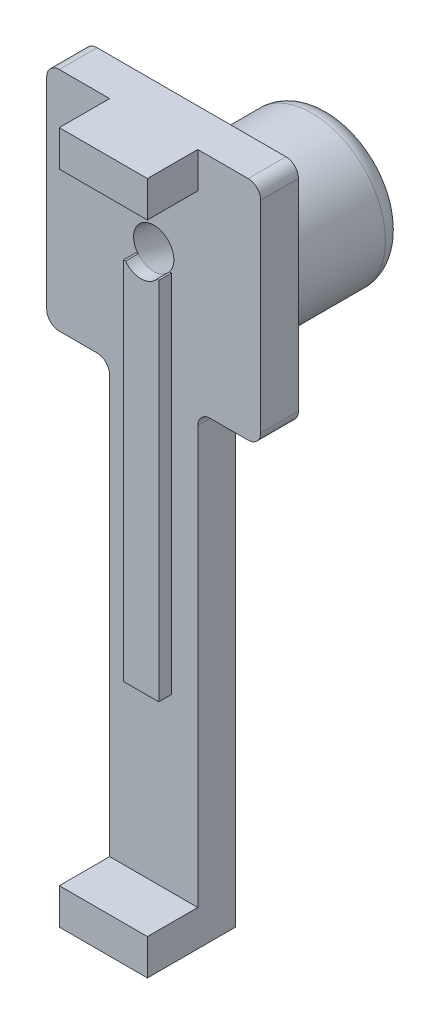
ISO-10303-21;
HEADER;
FILE_DESCRIPTION(('STEP AP214'),'2;1');
FILE_NAME('part.step','',(''),(''),'','','');
FILE_SCHEMA(('AUTOMOTIVE_DESIGN { 1 0 10303 214 1 1 1 1 }'));
ENDSEC;
DATA;
#1=APPLICATION_CONTEXT('core data for automotive mechanical design processes');
#2=APPLICATION_PROTOCOL_DEFINITION('international standard','automotive_design',2000,#1);
#3=PRODUCT_CONTEXT('',#1,'mechanical');
#4=PRODUCT('Part','Part','',(#3));
#5=PRODUCT_RELATED_PRODUCT_CATEGORY('part','',(#4));
#6=PRODUCT_DEFINITION_FORMATION('','',#4);
#7=PRODUCT_DEFINITION_CONTEXT('part definition',#1,'design');
#8=PRODUCT_DEFINITION('design','',#6,#7);
#9=PRODUCT_DEFINITION_SHAPE('','',#8);
#10=(LENGTH_UNIT() NAMED_UNIT(*) SI_UNIT(.MILLI.,.METRE.));
#11=(NAMED_UNIT(*) PLANE_ANGLE_UNIT() SI_UNIT($,.RADIAN.));
#12=(NAMED_UNIT(*) SI_UNIT($,.STERADIAN.) SOLID_ANGLE_UNIT());
#13=UNCERTAINTY_MEASURE_WITH_UNIT(LENGTH_MEASURE(1.E-05),#10,'distance_accuracy_value','');
#14=(GEOMETRIC_REPRESENTATION_CONTEXT(3) GLOBAL_UNCERTAINTY_ASSIGNED_CONTEXT((#13)) GLOBAL_UNIT_ASSIGNED_CONTEXT((#10,
#11,#12)) REPRESENTATION_CONTEXT('',''));
#15=CARTESIAN_POINT('',(0.,0.,0.));
#16=DIRECTION('',(0.,0.,1.));
#17=DIRECTION('',(1.,0.,0.));
#18=AXIS2_PLACEMENT_3D('',#15,#16,#17);
#19=CARTESIAN_POINT('',(1.4,26.9951042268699,4.));
#20=DIRECTION('',(0.,-1.,0.));
#21=DIRECTION('',(0.,0.,-1.));
#22=AXIS2_PLACEMENT_3D('',#19,#20,#21);
#23=PLANE('',#22);
#24=DIRECTION('',(-1.,0.,0.));
#25=VECTOR('',#24,1.);
#26=CARTESIAN_POINT('',(1.4,26.9951042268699,4.));
#27=LINE('',#26,#25);
#28=CARTESIAN_POINT('',(-1.24912299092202,26.9951042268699,4.));
#29=VERTEX_POINT('',#28);
#30=CARTESIAN_POINT('',(-1.4,26.9951042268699,4.));
#31=VERTEX_POINT('',#30);
#32=EDGE_CURVE('E244',#29,#31,#27,.T.);
#33=ORIENTED_EDGE('',*,*,#32,.F.);
#34=DIRECTION('',(0.,0.,-1.));
#35=VECTOR('',#34,1.);
#36=CARTESIAN_POINT('',(-1.24912299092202,26.9951042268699,13.));
#37=LINE('',#36,#35);
#38=CARTESIAN_POINT('',(-1.24912299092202,26.9951042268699,3.));
#39=VERTEX_POINT('',#38);
#40=EDGE_CURVE('E227',#29,#39,#37,.T.);
#41=ORIENTED_EDGE('',*,*,#40,.T.);
#42=DIRECTION('',(-1.,0.,0.));
#43=VECTOR('',#42,1.);
#44=CARTESIAN_POINT('',(1.4,26.9951042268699,3.));
#45=LINE('',#44,#43);
#46=CARTESIAN_POINT('',(-1.4,26.9951042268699,3.));
#47=VERTEX_POINT('',#46);
#48=EDGE_CURVE('E242',#39,#47,#45,.T.);
#49=ORIENTED_EDGE('',*,*,#48,.T.);
#50=DIRECTION('',(0.,0.,-1.));
#51=VECTOR('',#50,1.);
#52=CARTESIAN_POINT('',(-1.4,26.9951042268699,4.));
#53=LINE('',#52,#51);
#54=EDGE_CURVE('E286',#31,#47,#53,.T.);
#55=ORIENTED_EDGE('',*,*,#54,.F.);
#56=EDGE_LOOP('',(#33,#41,#49,#55));
#57=FACE_BOUND('',#56,.T.);
#58=ADVANCED_FACE('F49',(#57),#23,.F.);
#59=CARTESIAN_POINT('',(3.5,0.,3.));
#60=DIRECTION('',(-1.,0.,0.));
#61=DIRECTION('',(0.,0.,1.));
#62=AXIS2_PLACEMENT_3D('',#59,#60,#61);
#63=PLANE('',#62);
#64=DIRECTION('',(0.,1.,0.));
#65=VECTOR('',#64,1.);
#66=CARTESIAN_POINT('',(3.5,0.,0.));
#67=LINE('',#66,#65);
#68=CARTESIAN_POINT('',(3.5,-18.4548957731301,0.));
#69=VERTEX_POINT('',#68);
#70=CARTESIAN_POINT('',(3.5,17.5451042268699,0.));
#71=VERTEX_POINT('',#70);
#72=EDGE_CURVE('E305',#69,#71,#67,.T.);
#73=ORIENTED_EDGE('',*,*,#72,.T.);
#74=DIRECTION('',(0.,0.,-1.));
#75=VECTOR('',#74,1.);
#76=CARTESIAN_POINT('',(3.5,17.5451042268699,3.));
#77=LINE('',#76,#75);
#78=CARTESIAN_POINT('',(3.5,17.5451042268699,3.));
#79=VERTEX_POINT('',#78);
#80=EDGE_CURVE('E371',#71,#79,#77,.F.);
#81=ORIENTED_EDGE('',*,*,#80,.T.);
#82=DIRECTION('',(0.,1.,0.));
#83=VECTOR('',#82,1.);
#84=CARTESIAN_POINT('',(3.5,0.,3.));
#85=LINE('',#84,#83);
#86=CARTESIAN_POINT('',(3.5,-15.6048957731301,3.));
#87=VERTEX_POINT('',#86);
#88=EDGE_CURVE('E295',#87,#79,#85,.T.);
#89=ORIENTED_EDGE('',*,*,#88,.F.);
#90=DIRECTION('',(0.,0.,-1.));
#91=VECTOR('',#90,1.);
#92=CARTESIAN_POINT('',(3.5,-15.6048957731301,7.));
#93=LINE('',#92,#91);
#94=CARTESIAN_POINT('',(3.5,-15.6048957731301,7.));
#95=VERTEX_POINT('',#94);
#96=EDGE_CURVE('E627',#95,#87,#93,.T.);
#97=ORIENTED_EDGE('',*,*,#96,.F.);
#98=DIRECTION('',(0.,1.,0.));
#99=VECTOR('',#98,1.);
#100=CARTESIAN_POINT('',(3.5,-18.4548957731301,7.));
#101=LINE('',#100,#99);
#102=CARTESIAN_POINT('',(3.5,-18.4548957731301,7.));
#103=VERTEX_POINT('',#102);
#104=EDGE_CURVE('E611',#103,#95,#101,.T.);
#105=ORIENTED_EDGE('',*,*,#104,.F.);
#106=DIRECTION('',(0.,0.,-1.));
#107=VECTOR('',#106,1.);
#108=CARTESIAN_POINT('',(3.5,-18.4548957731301,3.));
#109=LINE('',#108,#107);
#110=EDGE_CURVE('E314',#103,#69,#109,.T.);
#111=ORIENTED_EDGE('',*,*,#110,.T.);
#112=EDGE_LOOP('',(#73,#81,#89,#97,#105,#111));
#113=FACE_BOUND('',#112,.T.);
#114=ADVANCED_FACE('F528',(#113),#63,.F.);
#115=DIRECTION('',(0.,-1.,0.));
#116=VECTOR('',#115,1.);
#117=CARTESIAN_POINT('',(3.5,36.5451042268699,3.));
#118=LINE('',#117,#116);
#119=CARTESIAN_POINT('',(3.5,36.5451042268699,3.));
#120=VERTEX_POINT('',#119);
#121=CARTESIAN_POINT('',(3.5,33.6951042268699,3.));
#122=VERTEX_POINT('',#121);
#123=EDGE_CURVE('E235',#120,#122,#118,.T.);
#124=ORIENTED_EDGE('',*,*,#123,.F.);
#125=DIRECTION('',(0.,0.,-1.));
#126=VECTOR('',#125,1.);
#127=CARTESIAN_POINT('',(3.5,36.5451042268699,3.));
#128=LINE('',#127,#126);
#129=CARTESIAN_POINT('',(3.5,36.5451042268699,7.));
#130=VERTEX_POINT('',#129);
#131=EDGE_CURVE('E311',#130,#120,#128,.T.);
#132=ORIENTED_EDGE('',*,*,#131,.F.);
#133=DIRECTION('',(0.,1.,0.));
#134=VECTOR('',#133,1.);
#135=CARTESIAN_POINT('',(3.5,36.5451042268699,7.));
#136=LINE('',#135,#134);
#137=CARTESIAN_POINT('',(3.5,33.6951042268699,7.));
#138=VERTEX_POINT('',#137);
#139=EDGE_CURVE('E636',#138,#130,#136,.T.);
#140=ORIENTED_EDGE('',*,*,#139,.F.);
#141=DIRECTION('',(0.,0.,-1.));
#142=VECTOR('',#141,1.);
#143=CARTESIAN_POINT('',(3.5,33.6951042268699,7.));
#144=LINE('',#143,#142);
#145=EDGE_CURVE('E642',#138,#122,#144,.T.);
#146=ORIENTED_EDGE('',*,*,#145,.T.);
#147=EDGE_LOOP('',(#124,#132,#140,#146));
#148=FACE_BOUND('',#147,.T.);
#149=ADVANCED_FACE('F532',(#148),#63,.F.);
#150=CARTESIAN_POINT('',(-3.5,0.,3.));
#151=DIRECTION('',(-1.,0.,0.));
#152=DIRECTION('',(0.,0.,1.));
#153=AXIS2_PLACEMENT_3D('',#150,#151,#152);
#154=PLANE('',#153);
#155=DIRECTION('',(0.,1.,0.));
#156=VECTOR('',#155,1.);
#157=CARTESIAN_POINT('',(-3.5,36.5451042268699,3.));
#158=LINE('',#157,#156);
#159=CARTESIAN_POINT('',(-3.5,33.6951042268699,3.));
#160=VERTEX_POINT('',#159);
#161=CARTESIAN_POINT('',(-3.5,36.5451042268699,3.));
#162=VERTEX_POINT('',#161);
#163=EDGE_CURVE('E318',#160,#162,#158,.T.);
#164=ORIENTED_EDGE('',*,*,#163,.F.);
#165=DIRECTION('',(0.,0.,-1.));
#166=VECTOR('',#165,1.);
#167=CARTESIAN_POINT('',(-3.5,33.6951042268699,7.));
#168=LINE('',#167,#166);
#169=CARTESIAN_POINT('',(-3.5,33.6951042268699,7.));
#170=VERTEX_POINT('',#169);
#171=EDGE_CURVE('E265',#170,#160,#168,.T.);
#172=ORIENTED_EDGE('',*,*,#171,.F.);
#173=DIRECTION('',(0.,-1.,0.));
#174=VECTOR('',#173,1.);
#175=CARTESIAN_POINT('',(-3.5,36.5451042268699,7.));
#176=LINE('',#175,#174);
#177=CARTESIAN_POINT('',(-3.5,36.5451042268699,7.));
#178=VERTEX_POINT('',#177);
#179=EDGE_CURVE('E631',#178,#170,#176,.T.);
#180=ORIENTED_EDGE('',*,*,#179,.F.);
#181=DIRECTION('',(0.,0.,-1.));
#182=VECTOR('',#181,1.);
#183=CARTESIAN_POINT('',(-3.5,36.5451042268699,3.));
#184=LINE('',#183,#182);
#185=EDGE_CURVE('E299',#178,#162,#184,.T.);
#186=ORIENTED_EDGE('',*,*,#185,.T.);
#187=EDGE_LOOP('',(#164,#172,#180,#186));
#188=FACE_BOUND('',#187,.T.);
#189=ADVANCED_FACE('F460',(#188),#154,.T.);
#190=CARTESIAN_POINT('',(0.,0.,3.));
#191=DIRECTION('',(0.,0.,1.));
#192=DIRECTION('',(1.,0.,0.));
#193=AXIS2_PLACEMENT_3D('',#190,#191,#192);
#194=PLANE('',#193);
#195=CARTESIAN_POINT('',(0.,27.9951042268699,3.));
#196=DIRECTION('',(0.,0.,1.));
#197=DIRECTION('',(1.,0.,0.));
#198=AXIS2_PLACEMENT_3D('',#195,#196,#197);
#199=CIRCLE('',#198,1.6);
#200=CARTESIAN_POINT('',(1.24876445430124,26.995104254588,3.));
#201=VERTEX_POINT('',#200);
#202=EDGE_CURVE('E53',#201,#39,#199,.T.);
#203=ORIENTED_EDGE('',*,*,#202,.F.);
#204=CARTESIAN_POINT('',(1.4,26.9951042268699,3.));
#205=VERTEX_POINT('',#204);
#206=EDGE_CURVE('E260',#205,#201,#45,.T.);
#207=ORIENTED_EDGE('',*,*,#206,.F.);
#208=DIRECTION('',(0.,1.,0.));
#209=VECTOR('',#208,1.);
#210=CARTESIAN_POINT('',(1.4,-2.00489577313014,3.));
#211=LINE('',#210,#209);
#212=CARTESIAN_POINT('',(1.4,-2.00489577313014,3.));
#213=VERTEX_POINT('',#212);
#214=EDGE_CURVE('E261',#213,#205,#211,.T.);
#215=ORIENTED_EDGE('',*,*,#214,.F.);
#216=DIRECTION('',(1.,0.,0.));
#217=VECTOR('',#216,1.);
#218=CARTESIAN_POINT('',(-1.4,-2.00489577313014,3.));
#219=LINE('',#218,#217);
#220=CARTESIAN_POINT('',(-1.4,-2.00489577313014,3.));
#221=VERTEX_POINT('',#220);
#222=EDGE_CURVE('E275',#221,#213,#219,.T.);
#223=ORIENTED_EDGE('',*,*,#222,.F.);
#224=DIRECTION('',(0.,-1.,0.));
#225=VECTOR('',#224,1.);
#226=CARTESIAN_POINT('',(-1.4,26.9951042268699,3.));
#227=LINE('',#226,#225);
#228=EDGE_CURVE('E258',#47,#221,#227,.T.);
#229=ORIENTED_EDGE('',*,*,#228,.F.);
#230=ORIENTED_EDGE('',*,*,#48,.F.);
#231=EDGE_LOOP('',(#203,#207,#215,#223,#229,#230));
#232=FACE_BOUND('',#231,.T.);
#233=DIRECTION('',(0.,1.,0.));
#234=VECTOR('',#233,1.);
#235=CARTESIAN_POINT('',(-8.5,36.5451042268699,3.));
#236=LINE('',#235,#234);
#237=CARTESIAN_POINT('',(-8.5,19.5451042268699,3.));
#238=VERTEX_POINT('',#237);
#239=CARTESIAN_POINT('',(-8.5,35.5451042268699,3.));
#240=VERTEX_POINT('',#239);
#241=EDGE_CURVE('E597',#238,#240,#236,.T.);
#242=ORIENTED_EDGE('',*,*,#241,.F.);
#243=CARTESIAN_POINT('',(-7.5,19.5451042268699,3.));
#244=DIRECTION('',(0.,0.,1.));
#245=DIRECTION('',(1.,0.,0.));
#246=AXIS2_PLACEMENT_3D('',#243,#244,#245);
#247=CIRCLE('',#246,1.);
#248=CARTESIAN_POINT('',(-7.5,18.5451042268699,3.));
#249=VERTEX_POINT('',#248);
#250=EDGE_CURVE('E347',#238,#249,#247,.T.);
#251=ORIENTED_EDGE('',*,*,#250,.T.);
#252=DIRECTION('',(1.,0.,0.));
#253=VECTOR('',#252,1.);
#254=CARTESIAN_POINT('',(-8.5,18.5451042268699,3.));
#255=LINE('',#254,#253);
#256=CARTESIAN_POINT('',(-4.5,18.5451042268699,3.));
#257=VERTEX_POINT('',#256);
#258=EDGE_CURVE('E604',#249,#257,#255,.T.);
#259=ORIENTED_EDGE('',*,*,#258,.T.);
#260=CARTESIAN_POINT('',(-4.5,17.5451042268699,3.));
#261=DIRECTION('',(0.,0.,1.));
#262=DIRECTION('',(1.,0.,0.));
#263=AXIS2_PLACEMENT_3D('',#260,#261,#262);
#264=CIRCLE('',#263,1.);
#265=CARTESIAN_POINT('',(-3.5,17.5451042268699,3.));
#266=VERTEX_POINT('',#265);
#267=EDGE_CURVE('E373',#257,#266,#264,.F.);
#268=ORIENTED_EDGE('',*,*,#267,.T.);
#269=DIRECTION('',(0.,1.,0.));
#270=VECTOR('',#269,1.);
#271=CARTESIAN_POINT('',(-3.5,0.,3.));
#272=LINE('',#271,#270);
#273=CARTESIAN_POINT('',(-3.5,-15.6048957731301,3.));
#274=VERTEX_POINT('',#273);
#275=EDGE_CURVE('E292',#274,#266,#272,.T.);
#276=ORIENTED_EDGE('',*,*,#275,.F.);
#277=DIRECTION('',(-1.,0.,0.));
#278=VECTOR('',#277,1.);
#279=CARTESIAN_POINT('',(3.5,-15.6048957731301,3.));
#280=LINE('',#279,#278);
#281=EDGE_CURVE('E610',#87,#274,#280,.T.);
#282=ORIENTED_EDGE('',*,*,#281,.F.);
#283=ORIENTED_EDGE('',*,*,#88,.T.);
#284=CARTESIAN_POINT('',(4.5,17.5451042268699,3.));
#285=DIRECTION('',(0.,0.,1.));
#286=DIRECTION('',(1.,0.,0.));
#287=AXIS2_PLACEMENT_3D('',#284,#285,#286);
#288=CIRCLE('',#287,1.);
#289=CARTESIAN_POINT('',(4.5,18.5451042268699,3.));
#290=VERTEX_POINT('',#289);
#291=EDGE_CURVE('E12',#79,#290,#288,.F.);
#292=ORIENTED_EDGE('',*,*,#291,.T.);
#293=DIRECTION('',(-1.,0.,0.));
#294=VECTOR('',#293,1.);
#295=CARTESIAN_POINT('',(8.5,18.5451042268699,3.));
#296=LINE('',#295,#294);
#297=CARTESIAN_POINT('',(7.5,18.5451042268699,3.));
#298=VERTEX_POINT('',#297);
#299=EDGE_CURVE('E581',#298,#290,#296,.T.);
#300=ORIENTED_EDGE('',*,*,#299,.F.);
#301=CARTESIAN_POINT('',(7.5,19.5451042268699,3.));
#302=DIRECTION('',(0.,0.,1.));
#303=DIRECTION('',(1.,0.,0.));
#304=AXIS2_PLACEMENT_3D('',#301,#302,#303);
#305=CIRCLE('',#304,1.);
#306=CARTESIAN_POINT('',(8.5,19.5451042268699,3.));
#307=VERTEX_POINT('',#306);
#308=EDGE_CURVE('E341',#298,#307,#305,.T.);
#309=ORIENTED_EDGE('',*,*,#308,.T.);
#310=DIRECTION('',(0.,-1.,0.));
#311=VECTOR('',#310,1.);
#312=CARTESIAN_POINT('',(8.5,36.5451042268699,3.));
#313=LINE('',#312,#311);
#314=CARTESIAN_POINT('',(8.5,35.5451042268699,3.));
#315=VERTEX_POINT('',#314);
#316=EDGE_CURVE('E579',#315,#307,#313,.T.);
#317=ORIENTED_EDGE('',*,*,#316,.F.);
#318=CARTESIAN_POINT('',(7.5,35.5451042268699,3.));
#319=DIRECTION('',(0.,0.,1.));
#320=DIRECTION('',(1.,0.,0.));
#321=AXIS2_PLACEMENT_3D('',#318,#319,#320);
#322=CIRCLE('',#321,1.);
#323=CARTESIAN_POINT('',(7.5,36.5451042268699,3.));
#324=VERTEX_POINT('',#323);
#325=EDGE_CURVE('E343',#315,#324,#322,.T.);
#326=ORIENTED_EDGE('',*,*,#325,.T.);
#327=DIRECTION('',(-1.,0.,0.));
#328=VECTOR('',#327,1.);
#329=CARTESIAN_POINT('',(8.5,36.5451042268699,3.));
#330=LINE('',#329,#328);
#331=EDGE_CURVE('E592',#324,#120,#330,.T.);
#332=ORIENTED_EDGE('',*,*,#331,.T.);
#333=ORIENTED_EDGE('',*,*,#123,.T.);
#334=DIRECTION('',(1.,0.,0.));
#335=VECTOR('',#334,1.);
#336=CARTESIAN_POINT('',(-3.5,33.6951042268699,3.));
#337=LINE('',#336,#335);
#338=EDGE_CURVE('E630',#160,#122,#337,.T.);
#339=ORIENTED_EDGE('',*,*,#338,.F.);
#340=ORIENTED_EDGE('',*,*,#163,.T.);
#341=DIRECTION('',(1.,0.,0.));
#342=VECTOR('',#341,1.);
#343=CARTESIAN_POINT('',(-8.5,36.5451042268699,3.));
#344=LINE('',#343,#342);
#345=CARTESIAN_POINT('',(-7.5,36.5451042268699,3.));
#346=VERTEX_POINT('',#345);
#347=EDGE_CURVE('E600',#346,#162,#344,.T.);
#348=ORIENTED_EDGE('',*,*,#347,.F.);
#349=CARTESIAN_POINT('',(-7.5,35.5451042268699,3.));
#350=DIRECTION('',(0.,0.,1.));
#351=DIRECTION('',(1.,0.,0.));
#352=AXIS2_PLACEMENT_3D('',#349,#350,#351);
#353=CIRCLE('',#352,1.);
#354=EDGE_CURVE('E345',#346,#240,#353,.T.);
#355=ORIENTED_EDGE('',*,*,#354,.T.);
#356=EDGE_LOOP('',(#242,#251,#259,#268,#276,#282,#283,#292,#300,#309,#317,#326,#332,#333,#339,
#340,#348,#355));
#357=FACE_BOUND('',#356,.T.);
#358=ADVANCED_FACE('F255',(#232,#357),#194,.T.);
#359=ORIENTED_EDGE('',*,*,#275,.T.);
#360=DIRECTION('',(0.,0.,1.));
#361=VECTOR('',#360,1.);
#362=CARTESIAN_POINT('',(-3.5,17.5451042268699,2.99999999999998));
#363=LINE('',#362,#361);
#364=CARTESIAN_POINT('',(-3.5,17.5451042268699,0.));
#365=VERTEX_POINT('',#364);
#366=EDGE_CURVE('E333',#266,#365,#363,.F.);
#367=ORIENTED_EDGE('',*,*,#366,.T.);
#368=DIRECTION('',(0.,1.,0.));
#369=VECTOR('',#368,1.);
#370=CARTESIAN_POINT('',(-3.5,0.,0.));
#371=LINE('',#370,#369);
#372=CARTESIAN_POINT('',(-3.5,-18.4548957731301,0.));
#373=VERTEX_POINT('',#372);
#374=EDGE_CURVE('E291',#373,#365,#371,.T.);
#375=ORIENTED_EDGE('',*,*,#374,.F.);
#376=DIRECTION('',(0.,0.,-1.));
#377=VECTOR('',#376,1.);
#378=CARTESIAN_POINT('',(-3.5,-18.4548957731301,3.));
#379=LINE('',#378,#377);
#380=CARTESIAN_POINT('',(-3.5,-18.4548957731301,7.));
#381=VERTEX_POINT('',#380);
#382=EDGE_CURVE('E316',#381,#373,#379,.T.);
#383=ORIENTED_EDGE('',*,*,#382,.F.);
#384=DIRECTION('',(0.,-1.,0.));
#385=VECTOR('',#384,1.);
#386=CARTESIAN_POINT('',(-3.5,-18.4548957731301,7.));
#387=LINE('',#386,#385);
#388=CARTESIAN_POINT('',(-3.5,-15.6048957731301,7.));
#389=VERTEX_POINT('',#388);
#390=EDGE_CURVE('E616',#389,#381,#387,.T.);
#391=ORIENTED_EDGE('',*,*,#390,.F.);
#392=DIRECTION('',(0.,0.,-1.));
#393=VECTOR('',#392,1.);
#394=CARTESIAN_POINT('',(-3.5,-15.6048957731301,7.));
#395=LINE('',#394,#393);
#396=EDGE_CURVE('E622',#389,#274,#395,.T.);
#397=ORIENTED_EDGE('',*,*,#396,.T.);
#398=EDGE_LOOP('',(#359,#367,#375,#383,#391,#397));
#399=FACE_BOUND('',#398,.T.);
#400=ADVANCED_FACE('F459',(#399),#154,.T.);
#401=CARTESIAN_POINT('',(0.,-18.4548957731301,3.));
#402=DIRECTION('',(0.,-1.,0.));
#403=DIRECTION('',(0.,0.,-1.));
#404=AXIS2_PLACEMENT_3D('',#401,#402,#403);
#405=PLANE('',#404);
#406=DIRECTION('',(-1.,0.,0.));
#407=VECTOR('',#406,1.);
#408=CARTESIAN_POINT('',(0.,-18.4548957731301,0.));
#409=LINE('',#408,#407);
#410=EDGE_CURVE('E302',#69,#373,#409,.T.);
#411=ORIENTED_EDGE('',*,*,#410,.F.);
#412=ORIENTED_EDGE('',*,*,#110,.F.);
#413=DIRECTION('',(1.,0.,0.));
#414=VECTOR('',#413,1.);
#415=CARTESIAN_POINT('',(3.5,-18.4548957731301,7.));
#416=LINE('',#415,#414);
#417=EDGE_CURVE('E619',#381,#103,#416,.T.);
#418=ORIENTED_EDGE('',*,*,#417,.F.);
#419=ORIENTED_EDGE('',*,*,#382,.T.);
#420=EDGE_LOOP('',(#411,#412,#418,#419));
#421=FACE_BOUND('',#420,.T.);
#422=ADVANCED_FACE('F541',(#421),#405,.T.);
#423=CARTESIAN_POINT('',(0.,36.5451042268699,3.));
#424=DIRECTION('',(0.,-1.,0.));
#425=DIRECTION('',(0.,0.,-1.));
#426=AXIS2_PLACEMENT_3D('',#423,#424,#425);
#427=PLANE('',#426);
#428=DIRECTION('',(-1.,0.,0.));
#429=VECTOR('',#428,1.);
#430=CARTESIAN_POINT('',(0.,36.5451042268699,0.));
#431=LINE('',#430,#429);
#432=CARTESIAN_POINT('',(7.5,36.5451042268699,0.));
#433=VERTEX_POINT('',#432);
#434=CARTESIAN_POINT('',(-7.5,36.5451042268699,0.));
#435=VERTEX_POINT('',#434);
#436=EDGE_CURVE('E296',#433,#435,#431,.T.);
#437=ORIENTED_EDGE('',*,*,#436,.T.);
#438=DIRECTION('',(0.,0.,-1.));
#439=VECTOR('',#438,1.);
#440=CARTESIAN_POINT('',(-7.5,36.5451042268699,3.));
#441=LINE('',#440,#439);
#442=EDGE_CURVE('E359',#435,#346,#441,.F.);
#443=ORIENTED_EDGE('',*,*,#442,.T.);
#444=ORIENTED_EDGE('',*,*,#347,.T.);
#445=ORIENTED_EDGE('',*,*,#185,.F.);
#446=DIRECTION('',(-1.,0.,0.));
#447=VECTOR('',#446,1.);
#448=CARTESIAN_POINT('',(-3.5,36.5451042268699,7.));
#449=LINE('',#448,#447);
#450=EDGE_CURVE('E639',#130,#178,#449,.T.);
#451=ORIENTED_EDGE('',*,*,#450,.F.);
#452=ORIENTED_EDGE('',*,*,#131,.T.);
#453=ORIENTED_EDGE('',*,*,#331,.F.);
#454=DIRECTION('',(0.,0.,1.));
#455=VECTOR('',#454,1.);
#456=CARTESIAN_POINT('',(7.5,36.5451042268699,0.));
#457=LINE('',#456,#455);
#458=EDGE_CURVE('E357',#324,#433,#457,.F.);
#459=ORIENTED_EDGE('',*,*,#458,.T.);
#460=EDGE_LOOP('',(#437,#443,#444,#445,#451,#452,#453,#459));
#461=FACE_BOUND('',#460,.T.);
#462=ADVANCED_FACE('F540',(#461),#427,.F.);
#463=CARTESIAN_POINT('',(0.,0.,0.));
#464=DIRECTION('',(0.,0.,1.));
#465=DIRECTION('',(1.,0.,0.));
#466=AXIS2_PLACEMENT_3D('',#463,#464,#465);
#467=PLANE('',#466);
#468=CARTESIAN_POINT('',(0.,-16.4548957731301,0.));
#469=DIRECTION('',(0.,0.,-1.));
#470=DIRECTION('',(-1.,0.,0.));
#471=AXIS2_PLACEMENT_3D('',#468,#469,#470);
#472=CIRCLE('',#471,0.5);
#473=CARTESIAN_POINT('',(-0.5,-16.4548957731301,0.));
#474=VERTEX_POINT('',#473);
#475=EDGE_CURVE('E705',#474,#474,#472,.T.);
#476=ORIENTED_EDGE('',*,*,#475,.F.);
#477=EDGE_LOOP('',(#476));
#478=FACE_BOUND('',#477,.T.);
#479=CARTESIAN_POINT('',(0.,-14.4548957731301,0.));
#480=DIRECTION('',(0.,0.,-1.));
#481=DIRECTION('',(-1.,0.,0.));
#482=AXIS2_PLACEMENT_3D('',#479,#480,#481);
#483=CIRCLE('',#482,0.5);
#484=CARTESIAN_POINT('',(-0.5,-14.4548957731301,0.));
#485=VERTEX_POINT('',#484);
#486=EDGE_CURVE('E709',#485,#485,#483,.T.);
#487=ORIENTED_EDGE('',*,*,#486,.F.);
#488=EDGE_LOOP('',(#487));
#489=FACE_BOUND('',#488,.T.);
#490=CARTESIAN_POINT('',(0.,25.1701042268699,0.));
#491=DIRECTION('',(0.,0.,1.));
#492=DIRECTION('',(1.,0.,0.));
#493=AXIS2_PLACEMENT_3D('',#490,#491,#492);
#494=CIRCLE('',#493,5.85);
#495=CARTESIAN_POINT('',(5.85,25.1701042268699,0.));
#496=VERTEX_POINT('',#495);
#497=EDGE_CURVE('E319',#496,#496,#494,.F.);
#498=ORIENTED_EDGE('',*,*,#497,.F.);
#499=EDGE_LOOP('',(#498));
#500=FACE_BOUND('',#499,.T.);
#501=DIRECTION('',(1.,0.,0.));
#502=VECTOR('',#501,1.);
#503=CARTESIAN_POINT('',(-8.5,18.5451042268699,0.));
#504=LINE('',#503,#502);
#505=CARTESIAN_POINT('',(-7.5,18.5451042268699,0.));
#506=VERTEX_POINT('',#505);
#507=CARTESIAN_POINT('',(-4.5,18.5451042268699,0.));
#508=VERTEX_POINT('',#507);
#509=EDGE_CURVE('E607',#506,#508,#504,.T.);
#510=ORIENTED_EDGE('',*,*,#509,.F.);
#511=CARTESIAN_POINT('',(-7.5,19.5451042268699,0.));
#512=DIRECTION('',(0.,0.,1.));
#513=DIRECTION('',(1.,0.,0.));
#514=AXIS2_PLACEMENT_3D('',#511,#512,#513);
#515=CIRCLE('',#514,1.);
#516=CARTESIAN_POINT('',(-8.5,19.5451042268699,0.));
#517=VERTEX_POINT('',#516);
#518=EDGE_CURVE('E355',#506,#517,#515,.F.);
#519=ORIENTED_EDGE('',*,*,#518,.T.);
#520=DIRECTION('',(0.,-1.,0.));
#521=VECTOR('',#520,1.);
#522=CARTESIAN_POINT('',(-8.5,36.5451042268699,0.));
#523=LINE('',#522,#521);
#524=CARTESIAN_POINT('',(-8.5,35.5451042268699,0.));
#525=VERTEX_POINT('',#524);
#526=EDGE_CURVE('E594',#525,#517,#523,.T.);
#527=ORIENTED_EDGE('',*,*,#526,.F.);
#528=CARTESIAN_POINT('',(-7.5,35.5451042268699,0.));
#529=DIRECTION('',(0.,0.,1.));
#530=DIRECTION('',(1.,0.,0.));
#531=AXIS2_PLACEMENT_3D('',#528,#529,#530);
#532=CIRCLE('',#531,1.);
#533=EDGE_CURVE('E353',#525,#435,#532,.F.);
#534=ORIENTED_EDGE('',*,*,#533,.T.);
#535=ORIENTED_EDGE('',*,*,#436,.F.);
#536=CARTESIAN_POINT('',(7.5,35.5451042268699,0.));
#537=DIRECTION('',(0.,0.,1.));
#538=DIRECTION('',(1.,0.,0.));
#539=AXIS2_PLACEMENT_3D('',#536,#537,#538);
#540=CIRCLE('',#539,1.);
#541=CARTESIAN_POINT('',(8.5,35.5451042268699,0.));
#542=VERTEX_POINT('',#541);
#543=EDGE_CURVE('E351',#433,#542,#540,.F.);
#544=ORIENTED_EDGE('',*,*,#543,.T.);
#545=DIRECTION('',(0.,1.,0.));
#546=VECTOR('',#545,1.);
#547=CARTESIAN_POINT('',(8.5,18.5451042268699,0.));
#548=LINE('',#547,#546);
#549=CARTESIAN_POINT('',(8.5,19.5451042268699,0.));
#550=VERTEX_POINT('',#549);
#551=EDGE_CURVE('E586',#550,#542,#548,.T.);
#552=ORIENTED_EDGE('',*,*,#551,.F.);
#553=CARTESIAN_POINT('',(7.5,19.5451042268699,0.));
#554=DIRECTION('',(0.,0.,1.));
#555=DIRECTION('',(1.,0.,0.));
#556=AXIS2_PLACEMENT_3D('',#553,#554,#555);
#557=CIRCLE('',#556,1.);
#558=CARTESIAN_POINT('',(7.5,18.5451042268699,0.));
#559=VERTEX_POINT('',#558);
#560=EDGE_CURVE('E349',#550,#559,#557,.F.);
#561=ORIENTED_EDGE('',*,*,#560,.T.);
#562=DIRECTION('',(-1.,0.,0.));
#563=VECTOR('',#562,1.);
#564=CARTESIAN_POINT('',(8.5,18.5451042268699,0.));
#565=LINE('',#564,#563);
#566=CARTESIAN_POINT('',(4.5,18.5451042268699,0.));
#567=VERTEX_POINT('',#566);
#568=EDGE_CURVE('E585',#559,#567,#565,.T.);
#569=ORIENTED_EDGE('',*,*,#568,.T.);
#570=CARTESIAN_POINT('',(4.5,17.5451042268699,0.));
#571=DIRECTION('',(0.,0.,1.));
#572=DIRECTION('',(1.,0.,0.));
#573=AXIS2_PLACEMENT_3D('',#570,#571,#572);
#574=CIRCLE('',#573,1.);
#575=EDGE_CURVE('E59',#567,#71,#574,.T.);
#576=ORIENTED_EDGE('',*,*,#575,.T.);
#577=ORIENTED_EDGE('',*,*,#72,.F.);
#578=ORIENTED_EDGE('',*,*,#410,.T.);
#579=ORIENTED_EDGE('',*,*,#374,.T.);
#580=CARTESIAN_POINT('',(-4.5,17.5451042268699,0.));
#581=DIRECTION('',(0.,0.,1.));
#582=DIRECTION('',(1.,0.,0.));
#583=AXIS2_PLACEMENT_3D('',#580,#581,#582);
#584=CIRCLE('',#583,1.);
#585=EDGE_CURVE('E375',#365,#508,#584,.T.);
#586=ORIENTED_EDGE('',*,*,#585,.T.);
#587=EDGE_LOOP('',(#510,#519,#527,#534,#535,#544,#552,#561,#569,#576,#577,#578,#579,#586));
#588=FACE_BOUND('',#587,.T.);
#589=ADVANCED_FACE('F454',(#478,#489,#500,#588),#467,.F.);
#590=CARTESIAN_POINT('',(1.4,-2.00489577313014,4.));
#591=DIRECTION('',(-1.,0.,0.));
#592=DIRECTION('',(0.,-1.,0.));
#593=AXIS2_PLACEMENT_3D('',#590,#591,#592);
#594=PLANE('',#593);
#595=ORIENTED_EDGE('',*,*,#214,.T.);
#596=DIRECTION('',(0.,0.,-1.));
#597=VECTOR('',#596,1.);
#598=CARTESIAN_POINT('',(1.4,26.9951042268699,4.));
#599=LINE('',#598,#597);
#600=CARTESIAN_POINT('',(1.4,26.9951042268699,4.));
#601=VERTEX_POINT('',#600);
#602=EDGE_CURVE('E288',#601,#205,#599,.T.);
#603=ORIENTED_EDGE('',*,*,#602,.F.);
#604=DIRECTION('',(0.,1.,0.));
#605=VECTOR('',#604,1.);
#606=CARTESIAN_POINT('',(1.4,-2.00489577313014,4.));
#607=LINE('',#606,#605);
#608=CARTESIAN_POINT('',(1.4,-2.00489577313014,4.));
#609=VERTEX_POINT('',#608);
#610=EDGE_CURVE('E278',#609,#601,#607,.T.);
#611=ORIENTED_EDGE('',*,*,#610,.F.);
#612=DIRECTION('',(0.,0.,-1.));
#613=VECTOR('',#612,1.);
#614=CARTESIAN_POINT('',(1.4,-2.00489577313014,4.));
#615=LINE('',#614,#613);
#616=EDGE_CURVE('E279',#609,#213,#615,.T.);
#617=ORIENTED_EDGE('',*,*,#616,.T.);
#618=EDGE_LOOP('',(#595,#603,#611,#617));
#619=FACE_BOUND('',#618,.T.);
#620=ADVANCED_FACE('F450',(#619),#594,.F.);
#621=ORIENTED_EDGE('',*,*,#206,.T.);
#622=DIRECTION('',(0.,0.,-1.));
#623=VECTOR('',#622,1.);
#624=CARTESIAN_POINT('',(1.24876445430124,26.995104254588,13.));
#625=LINE('',#624,#623);
#626=CARTESIAN_POINT('',(1.24876445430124,26.995104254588,4.));
#627=VERTEX_POINT('',#626);
#628=EDGE_CURVE('E230',#627,#201,#625,.T.);
#629=ORIENTED_EDGE('',*,*,#628,.F.);
#630=EDGE_CURVE('E651',#601,#627,#27,.T.);
#631=ORIENTED_EDGE('',*,*,#630,.F.);
#632=ORIENTED_EDGE('',*,*,#602,.T.);
#633=EDGE_LOOP('',(#621,#629,#631,#632));
#634=FACE_BOUND('',#633,.T.);
#635=ADVANCED_FACE('F446',(#634),#23,.F.);
#636=CARTESIAN_POINT('',(-1.4,26.9951042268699,4.));
#637=DIRECTION('',(1.,0.,0.));
#638=DIRECTION('',(0.,0.,-1.));
#639=AXIS2_PLACEMENT_3D('',#636,#637,#638);
#640=PLANE('',#639);
#641=ORIENTED_EDGE('',*,*,#228,.T.);
#642=DIRECTION('',(0.,0.,-1.));
#643=VECTOR('',#642,1.);
#644=CARTESIAN_POINT('',(-1.4,-2.00489577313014,4.));
#645=LINE('',#644,#643);
#646=CARTESIAN_POINT('',(-1.4,-2.00489577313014,4.));
#647=VERTEX_POINT('',#646);
#648=EDGE_CURVE('E282',#647,#221,#645,.T.);
#649=ORIENTED_EDGE('',*,*,#648,.F.);
#650=DIRECTION('',(0.,-1.,0.));
#651=VECTOR('',#650,1.);
#652=CARTESIAN_POINT('',(-1.4,26.9951042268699,4.));
#653=LINE('',#652,#651);
#654=EDGE_CURVE('E654',#31,#647,#653,.T.);
#655=ORIENTED_EDGE('',*,*,#654,.F.);
#656=ORIENTED_EDGE('',*,*,#54,.T.);
#657=EDGE_LOOP('',(#641,#649,#655,#656));
#658=FACE_BOUND('',#657,.T.);
#659=ADVANCED_FACE('F442',(#658),#640,.F.);
#660=CARTESIAN_POINT('',(-1.4,-2.00489577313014,4.));
#661=DIRECTION('',(0.,1.,0.));
#662=DIRECTION('',(0.,0.,1.));
#663=AXIS2_PLACEMENT_3D('',#660,#661,#662);
#664=PLANE('',#663);
#665=ORIENTED_EDGE('',*,*,#222,.T.);
#666=ORIENTED_EDGE('',*,*,#616,.F.);
#667=DIRECTION('',(1.,0.,0.));
#668=VECTOR('',#667,1.);
#669=CARTESIAN_POINT('',(-1.4,-2.00489577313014,4.));
#670=LINE('',#669,#668);
#671=EDGE_CURVE('E283',#647,#609,#670,.T.);
#672=ORIENTED_EDGE('',*,*,#671,.F.);
#673=ORIENTED_EDGE('',*,*,#648,.T.);
#674=EDGE_LOOP('',(#665,#666,#672,#673));
#675=FACE_BOUND('',#674,.T.);
#676=ADVANCED_FACE('F438',(#675),#664,.F.);
#677=CARTESIAN_POINT('',(0.,0.,4.));
#678=DIRECTION('',(0.,0.,1.));
#679=DIRECTION('',(1.,0.,0.));
#680=AXIS2_PLACEMENT_3D('',#677,#678,#679);
#681=PLANE('',#680);
#682=CARTESIAN_POINT('',(-0.000179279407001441,27.9951042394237,4.));
#683=DIRECTION('',(0.,0.,1.));
#684=DIRECTION('',(1.,0.,0.));
#685=AXIS2_PLACEMENT_3D('',#682,#683,#684);
#686=CIRCLE('',#685,1.59995638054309);
#687=EDGE_CURVE('E474',#29,#627,#686,.T.);
#688=ORIENTED_EDGE('',*,*,#687,.F.);
#689=ORIENTED_EDGE('',*,*,#32,.T.);
#690=ORIENTED_EDGE('',*,*,#654,.T.);
#691=ORIENTED_EDGE('',*,*,#671,.T.);
#692=ORIENTED_EDGE('',*,*,#610,.T.);
#693=ORIENTED_EDGE('',*,*,#630,.T.);
#694=EDGE_LOOP('',(#688,#689,#690,#691,#692,#693));
#695=FACE_BOUND('',#694,.T.);
#696=ADVANCED_FACE('F434',(#695),#681,.T.);
#697=CARTESIAN_POINT('',(-3.5,33.6951042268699,7.));
#698=DIRECTION('',(0.,1.,0.));
#699=DIRECTION('',(0.,0.,1.));
#700=AXIS2_PLACEMENT_3D('',#697,#698,#699);
#701=PLANE('',#700);
#702=ORIENTED_EDGE('',*,*,#338,.T.);
#703=ORIENTED_EDGE('',*,*,#145,.F.);
#704=DIRECTION('',(1.,0.,0.));
#705=VECTOR('',#704,1.);
#706=CARTESIAN_POINT('',(-3.5,33.6951042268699,7.));
#707=LINE('',#706,#705);
#708=EDGE_CURVE('E634',#170,#138,#707,.T.);
#709=ORIENTED_EDGE('',*,*,#708,.F.);
#710=ORIENTED_EDGE('',*,*,#171,.T.);
#711=EDGE_LOOP('',(#702,#703,#709,#710));
#712=FACE_BOUND('',#711,.T.);
#713=ADVANCED_FACE('F430',(#712),#701,.F.);
#714=CARTESIAN_POINT('',(0.,0.,7.));
#715=DIRECTION('',(0.,0.,1.));
#716=DIRECTION('',(1.,0.,0.));
#717=AXIS2_PLACEMENT_3D('',#714,#715,#716);
#718=PLANE('',#717);
#719=ORIENTED_EDGE('',*,*,#179,.T.);
#720=ORIENTED_EDGE('',*,*,#708,.T.);
#721=ORIENTED_EDGE('',*,*,#139,.T.);
#722=ORIENTED_EDGE('',*,*,#450,.T.);
#723=EDGE_LOOP('',(#719,#720,#721,#722));
#724=FACE_BOUND('',#723,.T.);
#725=ADVANCED_FACE('F426',(#724),#718,.T.);
#726=CARTESIAN_POINT('',(3.5,-15.6048957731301,7.));
#727=DIRECTION('',(0.,-1.,0.));
#728=DIRECTION('',(1.,0.,0.));
#729=AXIS2_PLACEMENT_3D('',#726,#727,#728);
#730=PLANE('',#729);
#731=ORIENTED_EDGE('',*,*,#281,.T.);
#732=ORIENTED_EDGE('',*,*,#396,.F.);
#733=DIRECTION('',(-1.,0.,0.));
#734=VECTOR('',#733,1.);
#735=CARTESIAN_POINT('',(3.5,-15.6048957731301,7.));
#736=LINE('',#735,#734);
#737=EDGE_CURVE('E614',#95,#389,#736,.T.);
#738=ORIENTED_EDGE('',*,*,#737,.F.);
#739=ORIENTED_EDGE('',*,*,#96,.T.);
#740=EDGE_LOOP('',(#731,#732,#738,#739));
#741=FACE_BOUND('',#740,.T.);
#742=ADVANCED_FACE('F422',(#741),#730,.F.);
#743=CARTESIAN_POINT('',(0.,0.,7.));
#744=DIRECTION('',(0.,0.,1.));
#745=DIRECTION('',(1.,0.,0.));
#746=AXIS2_PLACEMENT_3D('',#743,#744,#745);
#747=PLANE('',#746);
#748=ORIENTED_EDGE('',*,*,#104,.T.);
#749=ORIENTED_EDGE('',*,*,#737,.T.);
#750=ORIENTED_EDGE('',*,*,#390,.T.);
#751=ORIENTED_EDGE('',*,*,#417,.T.);
#752=EDGE_LOOP('',(#748,#749,#750,#751));
#753=FACE_BOUND('',#752,.T.);
#754=ADVANCED_FACE('F418',(#753),#747,.T.);
#755=CARTESIAN_POINT('',(-8.5,18.5451042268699,0.));
#756=DIRECTION('',(0.,1.,0.));
#757=DIRECTION('',(0.,0.,1.));
#758=AXIS2_PLACEMENT_3D('',#755,#756,#757);
#759=PLANE('',#758);
#760=ORIENTED_EDGE('',*,*,#509,.T.);
#761=DIRECTION('',(0.,0.,1.));
#762=VECTOR('',#761,1.);
#763=CARTESIAN_POINT('',(-4.5,18.5451042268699,0.));
#764=LINE('',#763,#762);
#765=EDGE_CURVE('E330',#508,#257,#764,.T.);
#766=ORIENTED_EDGE('',*,*,#765,.T.);
#767=ORIENTED_EDGE('',*,*,#258,.F.);
#768=DIRECTION('',(0.,0.,1.));
#769=VECTOR('',#768,1.);
#770=CARTESIAN_POINT('',(-7.5,18.5451042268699,0.));
#771=LINE('',#770,#769);
#772=EDGE_CURVE('E328',#249,#506,#771,.F.);
#773=ORIENTED_EDGE('',*,*,#772,.T.);
#774=EDGE_LOOP('',(#760,#766,#767,#773));
#775=FACE_BOUND('',#774,.T.);
#776=ADVANCED_FACE('F414',(#775),#759,.F.);
#777=CARTESIAN_POINT('',(-8.5,0.,0.));
#778=DIRECTION('',(-1.,0.,0.));
#779=DIRECTION('',(0.,0.,1.));
#780=AXIS2_PLACEMENT_3D('',#777,#778,#779);
#781=PLANE('',#780);
#782=ORIENTED_EDGE('',*,*,#526,.T.);
#783=DIRECTION('',(0.,0.,1.));
#784=VECTOR('',#783,1.);
#785=CARTESIAN_POINT('',(-8.5,19.5451042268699,3.));
#786=LINE('',#785,#784);
#787=EDGE_CURVE('E338',#517,#238,#786,.T.);
#788=ORIENTED_EDGE('',*,*,#787,.T.);
#789=ORIENTED_EDGE('',*,*,#241,.T.);
#790=DIRECTION('',(0.,0.,-1.));
#791=VECTOR('',#790,1.);
#792=CARTESIAN_POINT('',(-8.5,35.5451042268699,0.));
#793=LINE('',#792,#791);
#794=EDGE_CURVE('E335',#240,#525,#793,.T.);
#795=ORIENTED_EDGE('',*,*,#794,.T.);
#796=EDGE_LOOP('',(#782,#788,#789,#795));
#797=FACE_BOUND('',#796,.T.);
#798=ADVANCED_FACE('F410',(#797),#781,.T.);
#799=CARTESIAN_POINT('',(8.5,18.5451042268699,3.));
#800=DIRECTION('',(0.,1.,0.));
#801=DIRECTION('',(0.,0.,1.));
#802=AXIS2_PLACEMENT_3D('',#799,#800,#801);
#803=PLANE('',#802);
#804=ORIENTED_EDGE('',*,*,#568,.F.);
#805=DIRECTION('',(0.,0.,-1.));
#806=VECTOR('',#805,1.);
#807=CARTESIAN_POINT('',(7.5,18.5451042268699,3.));
#808=LINE('',#807,#806);
#809=EDGE_CURVE('E369',#559,#298,#808,.F.);
#810=ORIENTED_EDGE('',*,*,#809,.T.);
#811=ORIENTED_EDGE('',*,*,#299,.T.);
#812=DIRECTION('',(0.,0.,-1.));
#813=VECTOR('',#812,1.);
#814=CARTESIAN_POINT('',(4.5,18.5451042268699,0.));
#815=LINE('',#814,#813);
#816=EDGE_CURVE('E367',#290,#567,#815,.T.);
#817=ORIENTED_EDGE('',*,*,#816,.T.);
#818=EDGE_LOOP('',(#804,#810,#811,#817));
#819=FACE_BOUND('',#818,.T.);
#820=ADVANCED_FACE('F406',(#819),#803,.F.);
#821=CARTESIAN_POINT('',(8.5,0.,0.));
#822=DIRECTION('',(1.,0.,0.));
#823=DIRECTION('',(0.,0.,-1.));
#824=AXIS2_PLACEMENT_3D('',#821,#822,#823);
#825=PLANE('',#824);
#826=ORIENTED_EDGE('',*,*,#551,.T.);
#827=DIRECTION('',(0.,0.,1.));
#828=VECTOR('',#827,1.);
#829=CARTESIAN_POINT('',(8.5,35.5451042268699,3.));
#830=LINE('',#829,#828);
#831=EDGE_CURVE('E364',#542,#315,#830,.T.);
#832=ORIENTED_EDGE('',*,*,#831,.T.);
#833=ORIENTED_EDGE('',*,*,#316,.T.);
#834=DIRECTION('',(0.,0.,-1.));
#835=VECTOR('',#834,1.);
#836=CARTESIAN_POINT('',(8.5,19.5451042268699,0.));
#837=LINE('',#836,#835);
#838=EDGE_CURVE('E361',#307,#550,#837,.T.);
#839=ORIENTED_EDGE('',*,*,#838,.T.);
#840=EDGE_LOOP('',(#826,#832,#833,#839));
#841=FACE_BOUND('',#840,.T.);
#842=ADVANCED_FACE('F402',(#841),#825,.T.);
#843=CARTESIAN_POINT('',(0.,25.1701042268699,-11.06));
#844=DIRECTION('',(0.,0.,1.));
#845=DIRECTION('',(1.,0.,0.));
#846=AXIS2_PLACEMENT_3D('',#843,#844,#845);
#847=CYLINDRICAL_SURFACE('',#846,5.85);
#848=CARTESIAN_POINT('',(0.,25.1701042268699,-9.56));
#849=DIRECTION('',(0.,0.,-1.));
#850=DIRECTION('',(-1.,0.,0.));
#851=AXIS2_PLACEMENT_3D('',#848,#849,#850);
#852=CIRCLE('',#851,5.85);
#853=CARTESIAN_POINT('',(-5.85,25.1701042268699,-9.56));
#854=VERTEX_POINT('',#853);
#855=EDGE_CURVE('E325',#854,#854,#852,.F.);
#856=ORIENTED_EDGE('',*,*,#855,.T.);
#857=EDGE_LOOP('',(#856));
#858=FACE_BOUND('',#857,.T.);
#859=ORIENTED_EDGE('',*,*,#497,.T.);
#860=EDGE_LOOP('',(#859));
#861=FACE_BOUND('',#860,.T.);
#862=ADVANCED_FACE('F395',(#858,#861),#847,.T.);
#863=CARTESIAN_POINT('',(0.,25.1701042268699,-11.06));
#864=DIRECTION('',(0.,0.,-1.));
#865=DIRECTION('',(-1.,0.,0.));
#866=AXIS2_PLACEMENT_3D('',#863,#864,#865);
#867=PLANE('',#866);
#868=CARTESIAN_POINT('',(0.,25.1701042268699,-11.06));
#869=DIRECTION('',(0.,0.,-1.));
#870=DIRECTION('',(-1.,0.,0.));
#871=AXIS2_PLACEMENT_3D('',#868,#869,#870);
#872=CIRCLE('',#871,3.43686383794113);
#873=CARTESIAN_POINT('',(-3.43686383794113,25.1701042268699,-11.06));
#874=VERTEX_POINT('',#873);
#875=EDGE_CURVE('E252',#874,#874,#872,.T.);
#876=ORIENTED_EDGE('',*,*,#875,.F.);
#877=EDGE_LOOP('',(#876));
#878=FACE_BOUND('',#877,.T.);
#879=CARTESIAN_POINT('',(0.,25.1701042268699,-11.06));
#880=DIRECTION('',(0.,0.,-1.));
#881=DIRECTION('',(-1.,0.,0.));
#882=AXIS2_PLACEMENT_3D('',#879,#880,#881);
#883=CIRCLE('',#882,4.35);
#884=CARTESIAN_POINT('',(-4.35,25.1701042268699,-11.06));
#885=VERTEX_POINT('',#884);
#886=EDGE_CURVE('E322',#885,#885,#883,.T.);
#887=ORIENTED_EDGE('',*,*,#886,.T.);
#888=EDGE_LOOP('',(#887));
#889=FACE_BOUND('',#888,.T.);
#890=ADVANCED_FACE('F384',(#878,#889),#867,.T.);
#891=CARTESIAN_POINT('',(0.,25.1701042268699,-9.56));
#892=DIRECTION('',(0.,0.,-1.));
#893=DIRECTION('',(-1.,0.,0.));
#894=AXIS2_PLACEMENT_3D('',#891,#892,#893);
#895=TOROIDAL_SURFACE('',#894,4.35,1.5);
#896=ORIENTED_EDGE('',*,*,#855,.F.);
#897=EDGE_LOOP('',(#896));
#898=FACE_BOUND('',#897,.T.);
#899=ORIENTED_EDGE('',*,*,#886,.F.);
#900=EDGE_LOOP('',(#899));
#901=FACE_BOUND('',#900,.T.);
#902=ADVANCED_FACE('F394',(#898,#901),#895,.T.);
#903=CARTESIAN_POINT('',(-4.5,17.5451042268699,0.));
#904=DIRECTION('',(0.,0.,1.));
#905=DIRECTION('',(0.,-1.,0.));
#906=AXIS2_PLACEMENT_3D('',#903,#904,#905);
#907=CYLINDRICAL_SURFACE('',#906,1.);
#908=ORIENTED_EDGE('',*,*,#585,.F.);
#909=ORIENTED_EDGE('',*,*,#366,.F.);
#910=ORIENTED_EDGE('',*,*,#267,.F.);
#911=ORIENTED_EDGE('',*,*,#765,.F.);
#912=EDGE_LOOP('',(#908,#909,#910,#911));
#913=FACE_BOUND('',#912,.T.);
#914=ADVANCED_FACE('F550',(#913),#907,.F.);
#915=CARTESIAN_POINT('',(-7.5,19.5451042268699,0.));
#916=DIRECTION('',(0.,0.,-1.));
#917=DIRECTION('',(0.,1.,0.));
#918=AXIS2_PLACEMENT_3D('',#915,#916,#917);
#919=CYLINDRICAL_SURFACE('',#918,1.);
#920=ORIENTED_EDGE('',*,*,#518,.F.);
#921=ORIENTED_EDGE('',*,*,#772,.F.);
#922=ORIENTED_EDGE('',*,*,#250,.F.);
#923=ORIENTED_EDGE('',*,*,#787,.F.);
#924=EDGE_LOOP('',(#920,#921,#922,#923));
#925=FACE_BOUND('',#924,.T.);
#926=ADVANCED_FACE('F554',(#925),#919,.T.);
#927=CARTESIAN_POINT('',(-7.5,35.5451042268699,0.));
#928=DIRECTION('',(0.,0.,1.));
#929=DIRECTION('',(1.,0.,0.));
#930=AXIS2_PLACEMENT_3D('',#927,#928,#929);
#931=CYLINDRICAL_SURFACE('',#930,1.);
#932=ORIENTED_EDGE('',*,*,#354,.F.);
#933=ORIENTED_EDGE('',*,*,#442,.F.);
#934=ORIENTED_EDGE('',*,*,#533,.F.);
#935=ORIENTED_EDGE('',*,*,#794,.F.);
#936=EDGE_LOOP('',(#932,#933,#934,#935));
#937=FACE_BOUND('',#936,.T.);
#938=ADVANCED_FACE('F558',(#937),#931,.T.);
#939=CARTESIAN_POINT('',(7.5,35.5451042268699,0.));
#940=DIRECTION('',(0.,0.,-1.));
#941=DIRECTION('',(-1.,0.,0.));
#942=AXIS2_PLACEMENT_3D('',#939,#940,#941);
#943=CYLINDRICAL_SURFACE('',#942,1.);
#944=ORIENTED_EDGE('',*,*,#543,.F.);
#945=ORIENTED_EDGE('',*,*,#458,.F.);
#946=ORIENTED_EDGE('',*,*,#325,.F.);
#947=ORIENTED_EDGE('',*,*,#831,.F.);
#948=EDGE_LOOP('',(#944,#945,#946,#947));
#949=FACE_BOUND('',#948,.T.);
#950=ADVANCED_FACE('F562',(#949),#943,.T.);
#951=CARTESIAN_POINT('',(7.5,19.5451042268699,0.));
#952=DIRECTION('',(0.,0.,1.));
#953=DIRECTION('',(0.,-1.,0.));
#954=AXIS2_PLACEMENT_3D('',#951,#952,#953);
#955=CYLINDRICAL_SURFACE('',#954,1.);
#956=ORIENTED_EDGE('',*,*,#308,.F.);
#957=ORIENTED_EDGE('',*,*,#809,.F.);
#958=ORIENTED_EDGE('',*,*,#560,.F.);
#959=ORIENTED_EDGE('',*,*,#838,.F.);
#960=EDGE_LOOP('',(#956,#957,#958,#959));
#961=FACE_BOUND('',#960,.T.);
#962=ADVANCED_FACE('F565',(#961),#955,.T.);
#963=CARTESIAN_POINT('',(4.5,17.5451042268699,3.));
#964=DIRECTION('',(0.,0.,1.));
#965=DIRECTION('',(0.,-1.,0.));
#966=AXIS2_PLACEMENT_3D('',#963,#964,#965);
#967=CYLINDRICAL_SURFACE('',#966,1.);
#968=ORIENTED_EDGE('',*,*,#291,.F.);
#969=ORIENTED_EDGE('',*,*,#80,.F.);
#970=ORIENTED_EDGE('',*,*,#575,.F.);
#971=ORIENTED_EDGE('',*,*,#816,.F.);
#972=EDGE_LOOP('',(#968,#969,#970,#971));
#973=FACE_BOUND('',#972,.T.);
#974=ADVANCED_FACE('F51',(#973),#967,.F.);
#975=CARTESIAN_POINT('',(-1.56991621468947,28.2274553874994,-11.06));
#976=CARTESIAN_POINT('',(0.75667181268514,29.4048729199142,3.));
#977=CARTESIAN_POINT('',(-1.82469547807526,28.0966290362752,-11.06));
#978=CARTESIAN_POINT('',(0.639191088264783,29.4679289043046,3.));
#979=CARTESIAN_POINT('',(-2.09699329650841,27.9176571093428,-11.06));
#980=CARTESIAN_POINT('',(0.4986292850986,29.5249721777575,3.));
#981=CARTESIAN_POINT('',(-2.62936248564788,27.4135124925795,-11.06));
#982=CARTESIAN_POINT('',(0.164710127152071,29.5957283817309,3.));
#983=CARTESIAN_POINT('',(-2.88981950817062,27.086081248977,-11.06));
#984=CARTESIAN_POINT('',(-0.0296146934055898,29.6089921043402,3.));
#985=CARTESIAN_POINT('',(-3.1906057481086,26.4680125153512,-11.06));
#986=CARTESIAN_POINT('',(-0.345978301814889,29.5608873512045,3.));
#987=CARTESIAN_POINT('',(-3.27530084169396,26.2413120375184,-11.06));
#988=CARTESIAN_POINT('',(-0.455606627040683,29.5330178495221,3.));
#989=CARTESIAN_POINT('',(-3.39621401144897,25.7538954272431,-11.06));
#990=CARTESIAN_POINT('',(-0.674334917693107,29.4504793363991,3.));
#991=CARTESIAN_POINT('',(-3.43224819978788,25.4931627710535,-11.06));
#992=CARTESIAN_POINT('',(-0.783434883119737,29.3958103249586,3.));
#993=CARTESIAN_POINT('',(-3.44064557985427,24.9541122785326,-11.06));
#994=CARTESIAN_POINT('',(-0.99223051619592,29.2565424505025,3.));
#995=CARTESIAN_POINT('',(-3.41281982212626,24.6759206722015,-11.06));
#996=CARTESIAN_POINT('',(-1.09118652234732,29.1716827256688,3.));
#997=CARTESIAN_POINT('',(-3.28661964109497,24.1262230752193,-11.06));
#998=CARTESIAN_POINT('',(-1.26842761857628,28.9780398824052,3.));
#999=CARTESIAN_POINT('',(-3.18817751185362,23.8549672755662,-11.06));
#1000=CARTESIAN_POINT('',(-1.34671270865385,28.8692567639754,3.));
#1001=CARTESIAN_POINT('',(-2.92652480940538,23.3454087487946,-11.06));
#1002=CARTESIAN_POINT('',(-1.47282467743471,28.6342953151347,3.));
#1003=CARTESIAN_POINT('',(-2.76343809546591,23.1073472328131,-11.06));
#1004=CARTESIAN_POINT('',(-1.5202151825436,28.5089300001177,3.));
#1005=CARTESIAN_POINT('',(-2.39023771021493,22.6844815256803,-11.06));
#1006=CARTESIAN_POINT('',(-1.58363412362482,28.2541948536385,3.));
#1007=CARTESIAN_POINT('',(-2.1803668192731,22.499768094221,-11.06));
#1008=CARTESIAN_POINT('',(-1.59966255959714,28.1248250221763,3.));
#1009=CARTESIAN_POINT('',(-1.7373905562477,22.1924930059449,-11.06));
#1010=CARTESIAN_POINT('',(-1.60032625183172,27.8738455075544,3.));
#1011=CARTESIAN_POINT('',(-1.5044978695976,22.0698513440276,-11.06));
#1012=CARTESIAN_POINT('',(-1.5855877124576,27.7527080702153,3.));
#1013=CARTESIAN_POINT('',(-1.03792228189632,21.8841037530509,-11.06));
#1014=CARTESIAN_POINT('',(-1.53348431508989,27.5248047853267,3.));
#1015=CARTESIAN_POINT('',(-0.804333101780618,21.8208387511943,-11.06));
#1016=CARTESIAN_POINT('',(-1.49611945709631,27.4180389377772,3.));
#1017=CARTESIAN_POINT('',(-0.126766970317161,21.7051432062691,-11.06));
#1018=CARTESIAN_POINT('',(-1.36135708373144,27.1277992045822,3.));
#1019=CARTESIAN_POINT('',(0.291100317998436,21.7260240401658,-11.06));
#1020=CARTESIAN_POINT('',(-1.24290122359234,26.9731826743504,3.));
#1021=CARTESIAN_POINT('',(1.01102216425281,21.8649171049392,-11.06));
#1022=CARTESIAN_POINT('',(-0.99937912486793,26.734006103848,3.));
#1023=CARTESIAN_POINT('',(1.31513695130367,21.9819267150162,-11.06));
#1024=CARTESIAN_POINT('',(-0.874152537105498,26.648391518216,3.));
#1025=CARTESIAN_POINT('',(1.82469547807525,22.2435794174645,-11.06));
#1026=CARTESIAN_POINT('',(-0.639191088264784,26.5222795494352,3.));
#1027=CARTESIAN_POINT('',(2.09699329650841,22.4225513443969,-11.06));
#1028=CARTESIAN_POINT('',(-0.498629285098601,26.4652362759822,3.));
#1029=CARTESIAN_POINT('',(2.62936248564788,22.9266959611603,-11.06));
#1030=CARTESIAN_POINT('',(-0.164710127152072,26.3944800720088,3.));
#1031=CARTESIAN_POINT('',(2.88981950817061,23.2541272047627,-11.06));
#1032=CARTESIAN_POINT('',(0.0296146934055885,26.3812163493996,3.));
#1033=CARTESIAN_POINT('',(3.1906057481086,23.8721959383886,-11.06));
#1034=CARTESIAN_POINT('',(0.34597830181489,26.4293211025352,3.));
#1035=CARTESIAN_POINT('',(3.27530084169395,24.0988964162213,-11.06));
#1036=CARTESIAN_POINT('',(0.455606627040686,26.4571906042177,3.));
#1037=CARTESIAN_POINT('',(3.39621401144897,24.5863130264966,-11.06));
#1038=CARTESIAN_POINT('',(0.67433491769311,26.5397291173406,3.));
#1039=CARTESIAN_POINT('',(3.43224819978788,24.8470456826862,-11.06));
#1040=CARTESIAN_POINT('',(0.783434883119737,26.5943981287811,3.));
#1041=CARTESIAN_POINT('',(3.44064557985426,25.3860961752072,-11.06));
#1042=CARTESIAN_POINT('',(0.992230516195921,26.7336660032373,3.));
#1043=CARTESIAN_POINT('',(3.41281982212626,25.6642877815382,-11.06));
#1044=CARTESIAN_POINT('',(1.09118652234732,26.818525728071,3.));
#1045=CARTESIAN_POINT('',(3.28661964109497,26.2139853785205,-11.06));
#1046=CARTESIAN_POINT('',(1.26842761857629,27.0121685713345,3.));
#1047=CARTESIAN_POINT('',(3.18817751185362,26.4852411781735,-11.06));
#1048=CARTESIAN_POINT('',(1.34671270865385,27.1209516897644,3.));
#1049=CARTESIAN_POINT('',(2.92652480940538,26.9947997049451,-11.06));
#1050=CARTESIAN_POINT('',(1.47282467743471,27.3559131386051,3.));
#1051=CARTESIAN_POINT('',(2.76343809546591,27.2328612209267,-11.06));
#1052=CARTESIAN_POINT('',(1.5202151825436,27.481278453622,3.));
#1053=CARTESIAN_POINT('',(2.39023771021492,27.6557269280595,-11.06));
#1054=CARTESIAN_POINT('',(1.58363412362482,27.7360136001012,3.));
#1055=CARTESIAN_POINT('',(2.1803668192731,27.8404403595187,-11.06));
#1056=CARTESIAN_POINT('',(1.59966255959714,27.8653834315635,3.));
#1057=CARTESIAN_POINT('',(1.7373905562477,28.1477154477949,-11.06));
#1058=CARTESIAN_POINT('',(1.60032625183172,28.1163629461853,3.));
#1059=CARTESIAN_POINT('',(1.5044978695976,28.2703571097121,-11.06));
#1060=CARTESIAN_POINT('',(1.5855877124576,28.2375003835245,3.));
#1061=CARTESIAN_POINT('',(1.03792228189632,28.4561047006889,-11.06));
#1062=CARTESIAN_POINT('',(1.53348431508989,28.4654036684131,3.));
#1063=CARTESIAN_POINT('',(0.804333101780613,28.5193697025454,-11.06));
#1064=CARTESIAN_POINT('',(1.49611945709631,28.5721695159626,3.));
#1065=CARTESIAN_POINT('',(0.126766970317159,28.6350652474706,-11.06));
#1066=CARTESIAN_POINT('',(1.36135708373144,28.8624092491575,3.));
#1067=CARTESIAN_POINT('',(-0.29110031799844,28.614184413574,-11.06));
#1068=CARTESIAN_POINT('',(1.24290122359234,29.0170257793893,3.));
#1069=CARTESIAN_POINT('',(-1.01102216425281,28.4752913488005,-11.06));
#1070=CARTESIAN_POINT('',(0.99937912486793,29.2562023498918,3.));
#1071=CARTESIAN_POINT('',(-1.31513695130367,28.3582817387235,-11.06));
#1072=CARTESIAN_POINT('',(0.874152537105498,29.3418169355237,3.));
#1073=CARTESIAN_POINT('',(-1.56991621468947,28.2274553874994,-11.06));
#1074=CARTESIAN_POINT('',(0.75667181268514,29.4048729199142,3.));
#1075=B_SPLINE_SURFACE_WITH_KNOTS('',3,1,((#975,#976),(#977,#978),(#979,#980),(#981,#982),(#983,
#984),(#985,#986),(#987,#988),(#989,#990),(#991,#992),(#993,#994),(#995,#996),(#997,#998),(#999,
#1000),(#1001,#1002),(#1003,#1004),(#1005,#1006),(#1007,#1008),(#1009,#1010),(#1011,#1012),
(#1013,#1014),(#1015,#1016),(#1017,#1018),(#1019,#1020),(#1021,#1022),(#1023,#1024),(#1025,
#1026),(#1027,#1028),(#1029,#1030),(#1031,#1032),(#1033,#1034),(#1035,#1036),(#1037,#1038),
(#1039,#1040),(#1041,#1042),(#1043,#1044),(#1045,#1046),(#1047,#1048),(#1049,#1050),(#1051,
#1052),(#1053,#1054),(#1055,#1056),(#1057,#1058),(#1059,#1060),(#1061,#1062),(#1063,#1064),
(#1065,#1066),(#1067,#1068),(#1069,#1070),(#1071,#1072),(#1073,#1074)),.UNSPECIFIED.,.T.,.F.,
.F.,(4,2,2,2,2,2,2,2,2,2,2,2,2,2,2,2,2,2,2,2,2,2,2,2,4),(2,2),(0.,0.0624999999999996,
0.124999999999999,0.156249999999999,0.187499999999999,0.218749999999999,0.249999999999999,
0.281249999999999,0.312499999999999,0.343749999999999,0.374999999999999,0.437499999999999,
0.499999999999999,0.5625,0.625,0.65625,0.6875,0.71875,0.75,0.78125,0.8125,0.84375,0.875,0.9375,
1.),(0.,1.),.UNSPECIFIED.);
#1076=EDGE_CURVE('E223',#39,#201,#199,.T.);
#1077=ORIENTED_EDGE('',*,*,#875,.T.);
#1078=EDGE_LOOP('',(#1077));
#1079=FACE_BOUND('',#1078,.T.);
#1080=ORIENTED_EDGE('',*,*,#1076,.T.);
#1081=ORIENTED_EDGE('',*,*,#202,.T.);
#1082=EDGE_LOOP('',(#1080,#1081));
#1083=FACE_BOUND('',#1082,.T.);
#1084=ADVANCED_FACE('F248',(#1079,#1083),#1075,.F.);
#1085=CARTESIAN_POINT('',(-0.000179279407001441,27.9951042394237,13.));
#1086=DIRECTION('',(0.,0.,-1.));
#1087=DIRECTION('',(-1.,0.,0.));
#1088=AXIS2_PLACEMENT_3D('',#1085,#1086,#1087);
#1089=CYLINDRICAL_SURFACE('',#1088,1.59995638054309);
#1090=ORIENTED_EDGE('',*,*,#687,.T.);
#1091=ORIENTED_EDGE('',*,*,#628,.T.);
#1092=ORIENTED_EDGE('',*,*,#1076,.F.);
#1093=ORIENTED_EDGE('',*,*,#40,.F.);
#1094=EDGE_LOOP('',(#1090,#1091,#1092,#1093));
#1095=FACE_BOUND('',#1094,.T.);
#1096=ADVANCED_FACE('F226',(#1095),#1089,.F.);
#1097=CARTESIAN_POINT('',(0.,-14.4548957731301,2.5));
#1098=DIRECTION('',(0.,0.,-1.));
#1099=DIRECTION('',(-1.,0.,0.));
#1100=AXIS2_PLACEMENT_3D('',#1097,#1098,#1099);
#1101=CYLINDRICAL_SURFACE('',#1100,0.5);
#1102=CARTESIAN_POINT('',(0.,-14.4548957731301,2.5));
#1103=DIRECTION('',(0.,0.,-1.));
#1104=DIRECTION('',(-1.,0.,0.));
#1105=AXIS2_PLACEMENT_3D('',#1102,#1103,#1104);
#1106=CIRCLE('',#1105,0.5);
#1107=CARTESIAN_POINT('',(-0.5,-14.4548957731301,2.5));
#1108=VERTEX_POINT('',#1107);
#1109=EDGE_CURVE('E713',#1108,#1108,#1106,.T.);
#1110=ORIENTED_EDGE('',*,*,#1109,.F.);
#1111=EDGE_LOOP('',(#1110));
#1112=FACE_BOUND('',#1111,.T.);
#1113=ORIENTED_EDGE('',*,*,#486,.T.);
#1114=EDGE_LOOP('',(#1113));
#1115=FACE_BOUND('',#1114,.T.);
#1116=ADVANCED_FACE('F509',(#1112,#1115),#1101,.F.);
#1117=CARTESIAN_POINT('',(0.,-14.4548957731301,2.5));
#1118=DIRECTION('',(0.,0.,-1.));
#1119=DIRECTION('',(-1.,0.,0.));
#1120=AXIS2_PLACEMENT_3D('',#1117,#1118,#1119);
#1121=PLANE('',#1120);
#1122=ORIENTED_EDGE('',*,*,#1109,.T.);
#1123=EDGE_LOOP('',(#1122));
#1124=FACE_BOUND('',#1123,.T.);
#1125=ADVANCED_FACE('F512',(#1124),#1121,.T.);
#1126=CARTESIAN_POINT('',(0.,-16.4548957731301,2.5));
#1127=DIRECTION('',(0.,0.,-1.));
#1128=DIRECTION('',(-1.,0.,0.));
#1129=AXIS2_PLACEMENT_3D('',#1126,#1127,#1128);
#1130=CYLINDRICAL_SURFACE('',#1129,0.5);
#1131=CARTESIAN_POINT('',(0.,-16.4548957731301,2.5));
#1132=DIRECTION('',(0.,0.,-1.));
#1133=DIRECTION('',(-1.,0.,0.));
#1134=AXIS2_PLACEMENT_3D('',#1131,#1132,#1133);
#1135=CIRCLE('',#1134,0.5);
#1136=CARTESIAN_POINT('',(-0.5,-16.4548957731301,2.5));
#1137=VERTEX_POINT('',#1136);
#1138=EDGE_CURVE('E245',#1137,#1137,#1135,.T.);
#1139=ORIENTED_EDGE('',*,*,#1138,.F.);
#1140=EDGE_LOOP('',(#1139));
#1141=FACE_BOUND('',#1140,.T.);
#1142=ORIENTED_EDGE('',*,*,#475,.T.);
#1143=EDGE_LOOP('',(#1142));
#1144=FACE_BOUND('',#1143,.T.);
#1145=ADVANCED_FACE('F516',(#1141,#1144),#1130,.F.);
#1146=CARTESIAN_POINT('',(0.,-16.4548957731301,2.5));
#1147=DIRECTION('',(0.,0.,-1.));
#1148=DIRECTION('',(-1.,0.,0.));
#1149=AXIS2_PLACEMENT_3D('',#1146,#1147,#1148);
#1150=PLANE('',#1149);
#1151=ORIENTED_EDGE('',*,*,#1138,.T.);
#1152=EDGE_LOOP('',(#1151));
#1153=FACE_BOUND('',#1152,.T.);
#1154=ADVANCED_FACE('F520',(#1153),#1150,.T.);
#1155=CLOSED_SHELL('',(#58,#114,#149,#189,#358,#400,#422,#462,#589,#620,#635,#659,#676,#696,
#713,#725,#742,#754,#776,#798,#820,#842,#862,#890,#902,#914,#926,#938,#950,#962,#974,#1084,
#1096,#1116,#1125,#1145,#1154));
#1156=MANIFOLD_SOLID_BREP('B2',#1155);
#1157=ADVANCED_BREP_SHAPE_REPRESENTATION('',(#18,#1156),#14);
#1158=SHAPE_DEFINITION_REPRESENTATION(#9,#1157);
ENDSEC;
END-ISO-10303-21;
